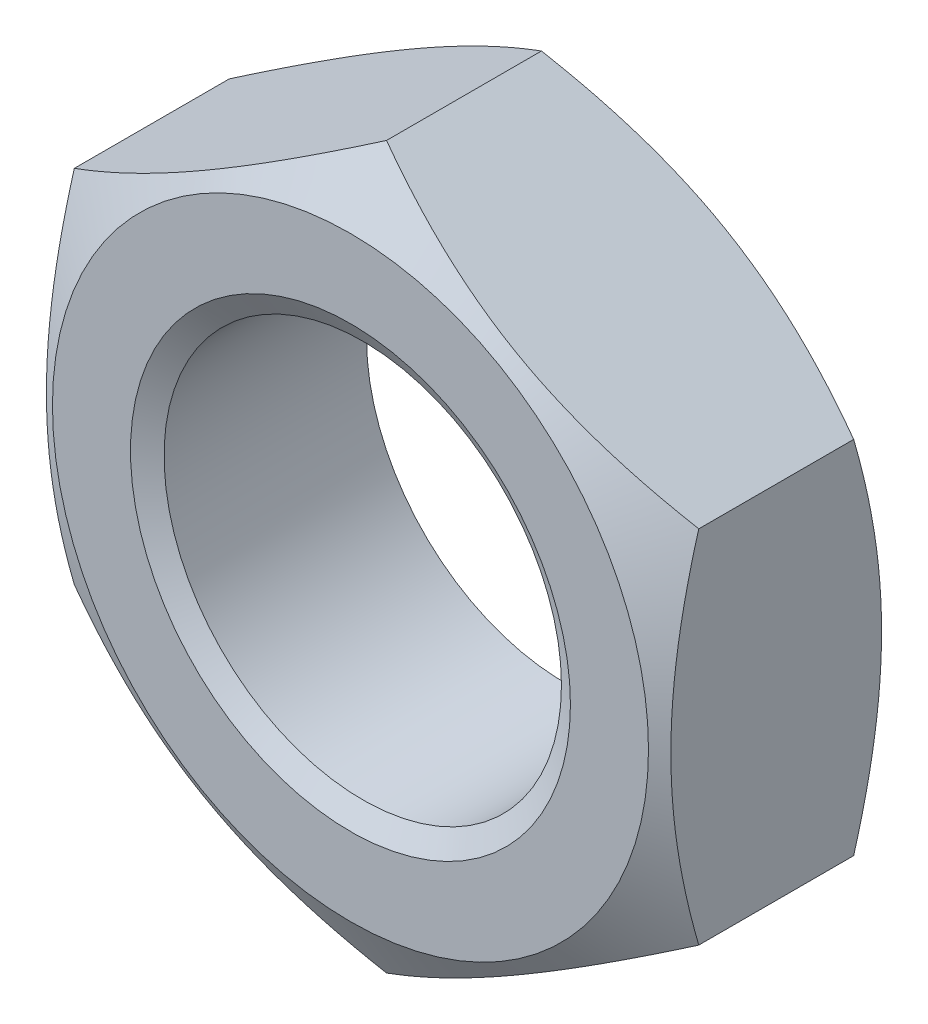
ISO-10303-21;
HEADER;
FILE_DESCRIPTION(('STEP AP214'),'2;1');
FILE_NAME('part.step','',(''),(''),'','','');
FILE_SCHEMA(('AUTOMOTIVE_DESIGN { 1 0 10303 214 1 1 1 1 }'));
ENDSEC;
DATA;
#1=APPLICATION_CONTEXT('core data for automotive mechanical design processes');
#2=APPLICATION_PROTOCOL_DEFINITION('international standard','automotive_design',2000,#1);
#3=PRODUCT_CONTEXT('',#1,'mechanical');
#4=PRODUCT('Part','Part','',(#3));
#5=PRODUCT_RELATED_PRODUCT_CATEGORY('part','',(#4));
#6=PRODUCT_DEFINITION_FORMATION('','',#4);
#7=PRODUCT_DEFINITION_CONTEXT('part definition',#1,'design');
#8=PRODUCT_DEFINITION('design','',#6,#7);
#9=PRODUCT_DEFINITION_SHAPE('','',#8);
#10=(LENGTH_UNIT() NAMED_UNIT(*) SI_UNIT(.MILLI.,.METRE.));
#11=(NAMED_UNIT(*) PLANE_ANGLE_UNIT() SI_UNIT($,.RADIAN.));
#12=(NAMED_UNIT(*) SI_UNIT($,.STERADIAN.) SOLID_ANGLE_UNIT());
#13=UNCERTAINTY_MEASURE_WITH_UNIT(LENGTH_MEASURE(1.E-05),#10,'distance_accuracy_value','');
#14=(GEOMETRIC_REPRESENTATION_CONTEXT(3) GLOBAL_UNCERTAINTY_ASSIGNED_CONTEXT((#13)) GLOBAL_UNIT_ASSIGNED_CONTEXT((#10,
#11,#12)) REPRESENTATION_CONTEXT('',''));
#15=CARTESIAN_POINT('',(0.,0.,0.));
#16=DIRECTION('',(0.,0.,1.));
#17=DIRECTION('',(1.,0.,0.));
#18=AXIS2_PLACEMENT_3D('',#15,#16,#17);
#19=CARTESIAN_POINT('',(11.,6.35085296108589,8.));
#20=DIRECTION('',(-0.5,-0.866025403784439,0.));
#21=DIRECTION('',(0.866025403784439,-0.5,0.));
#22=AXIS2_PLACEMENT_3D('',#19,#20,#21);
#23=PLANE('',#22);
#24=CARTESIAN_POINT('',(-0.000200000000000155,12.7018213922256,1.27122217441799));
#25=CARTESIAN_POINT('',(0.241603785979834,12.5622159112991,1.19063428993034));
#26=CARTESIAN_POINT('',(0.484309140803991,12.4220899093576,1.11370405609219));
#27=CARTESIAN_POINT('',(0.971666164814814,12.1407142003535,0.968173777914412));
#28=CARTESIAN_POINT('',(1.21631844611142,11.999464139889,0.899576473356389));
#29=CARTESIAN_POINT('',(1.9542173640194,11.5734380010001,0.707611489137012));
#30=CARTESIAN_POINT('',(2.45037695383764,11.2869801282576,0.598422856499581));
#31=CARTESIAN_POINT('',(3.19285703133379,10.8583090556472,0.470389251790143));
#32=CARTESIAN_POINT('',(3.43695934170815,10.7173765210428,0.433917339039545));
#33=CARTESIAN_POINT('',(3.92629418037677,10.4348589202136,0.372756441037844));
#34=CARTESIAN_POINT('',(4.17152673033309,10.2932738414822,0.348067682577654));
#35=CARTESIAN_POINT('',(4.66240068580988,10.0098676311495,0.31110548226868));
#36=CARTESIAN_POINT('',(4.90804125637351,9.86804698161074,0.298817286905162));
#37=CARTESIAN_POINT('',(5.39955001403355,9.58427426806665,0.286918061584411));
#38=CARTESIAN_POINT('',(5.64541819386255,9.44232220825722,0.287306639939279));
#39=CARTESIAN_POINT('',(6.10507018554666,9.17694200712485,0.299876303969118));
#40=CARTESIAN_POINT('',(6.31888677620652,9.05349494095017,0.310524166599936));
#41=CARTESIAN_POINT('',(6.74602818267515,8.80688473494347,0.341206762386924));
#42=CARTESIAN_POINT('',(6.95935296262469,8.68372161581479,0.361242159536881));
#43=CARTESIAN_POINT('',(7.3853948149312,8.43774623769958,0.410350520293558));
#44=CARTESIAN_POINT('',(7.5981112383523,8.31493435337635,0.439430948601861));
#45=CARTESIAN_POINT('',(8.02254681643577,8.06988635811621,0.50611913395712));
#46=CARTESIAN_POINT('',(8.23426590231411,7.94765028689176,0.543727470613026));
#47=CARTESIAN_POINT('',(8.87695113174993,7.5765957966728,0.670295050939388));
#48=CARTESIAN_POINT('',(9.30605612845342,7.32885191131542,0.771874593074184));
#49=CARTESIAN_POINT('',(10.1578675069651,6.83705838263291,1.00241883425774));
#50=CARTESIAN_POINT('',(10.580584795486,6.59300244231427,1.13132938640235));
#51=CARTESIAN_POINT('',(11.0002,6.35073749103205,1.27122217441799));
#52=B_SPLINE_CURVE_WITH_KNOTS('',3,(#24,#25,#26,#27,#28,#29,#30,#31,#32,#33,#34,#35,#36,#37,#38,
#39,#40,#41,#42,#43,#44,#45,#46,#47,#48,#49,#50,#51),.UNSPECIFIED.,.F.,.F.,(4,2,2,2,2,2,2,2,2,2,
2,2,2,4),(0.,0.871755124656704,1.74379610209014,3.49159027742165,4.34403665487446,
5.19649943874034,6.04794680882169,6.89936787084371,7.64056020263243,8.38180496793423,
9.12366309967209,9.86557166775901,11.3820155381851,12.8954827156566),.UNSPECIFIED.);
#53=CARTESIAN_POINT('',(0.,12.7017059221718,1.27115550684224));
#54=VERTEX_POINT('',#53);
#55=CARTESIAN_POINT('',(11.,6.35085296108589,1.27115550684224));
#56=VERTEX_POINT('',#55);
#57=EDGE_CURVE('E31',#54,#56,#52,.T.);
#58=ORIENTED_EDGE('',*,*,#57,.F.);
#59=DIRECTION('',(0.,0.,-1.));
#60=VECTOR('',#59,1.);
#61=CARTESIAN_POINT('',(0.,12.7017059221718,8.));
#62=LINE('',#61,#60);
#63=CARTESIAN_POINT('',(0.,12.7017059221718,6.72884449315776));
#64=VERTEX_POINT('',#63);
#65=EDGE_CURVE('E9',#64,#54,#62,.T.);
#66=ORIENTED_EDGE('',*,*,#65,.F.);
#67=CARTESIAN_POINT('',(11.0002,6.35073749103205,6.72877782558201));
#68=CARTESIAN_POINT('',(10.7583962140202,6.49034297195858,6.80936571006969));
#69=CARTESIAN_POINT('',(10.515690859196,6.63046897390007,6.88629594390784));
#70=CARTESIAN_POINT('',(10.0283338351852,6.91184468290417,7.03182622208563));
#71=CARTESIAN_POINT('',(9.78368155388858,7.05309474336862,7.10042352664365));
#72=CARTESIAN_POINT('',(9.0457826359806,7.47912088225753,7.29238851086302));
#73=CARTESIAN_POINT('',(8.54962304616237,7.7655787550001,7.40157714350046));
#74=CARTESIAN_POINT('',(7.80714296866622,8.19424982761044,7.5296107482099));
#75=CARTESIAN_POINT('',(7.56304065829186,8.33518236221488,7.5660826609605));
#76=CARTESIAN_POINT('',(7.07370581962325,8.61769996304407,7.6272435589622));
#77=CARTESIAN_POINT('',(6.82847326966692,8.75928504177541,7.65193231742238));
#78=CARTESIAN_POINT('',(6.33759931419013,9.04269125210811,7.68889451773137));
#79=CARTESIAN_POINT('',(6.09195874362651,9.18451190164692,7.70118271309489));
#80=CARTESIAN_POINT('',(5.60044998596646,9.468284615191,7.71308193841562));
#81=CARTESIAN_POINT('',(5.35458180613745,9.61023667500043,7.71269336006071));
#82=CARTESIAN_POINT('',(4.89492981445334,9.87561687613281,7.70012369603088));
#83=CARTESIAN_POINT('',(4.68111322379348,9.99906394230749,7.68947583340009));
#84=CARTESIAN_POINT('',(4.25397181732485,10.2456741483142,7.65879323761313));
#85=CARTESIAN_POINT('',(4.04064703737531,10.3688372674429,7.63875784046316));
#86=CARTESIAN_POINT('',(3.6146051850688,10.6148126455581,7.58964947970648));
#87=CARTESIAN_POINT('',(3.4018887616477,10.7376245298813,7.56056905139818));
#88=CARTESIAN_POINT('',(2.97745318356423,10.9826725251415,7.49388086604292));
#89=CARTESIAN_POINT('',(2.76573409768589,11.1049085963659,7.45627252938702));
#90=CARTESIAN_POINT('',(2.12304886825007,11.4759630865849,7.32970494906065));
#91=CARTESIAN_POINT('',(1.69394387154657,11.7237069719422,7.22812540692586));
#92=CARTESIAN_POINT('',(0.84213249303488,12.2155005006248,6.9975811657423));
#93=CARTESIAN_POINT('',(0.419415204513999,12.4595564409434,6.86867061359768));
#94=CARTESIAN_POINT('',(-0.000200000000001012,12.7018213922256,6.72877782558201));
#95=B_SPLINE_CURVE_WITH_KNOTS('',3,(#67,#68,#69,#70,#71,#72,#73,#74,#75,#76,#77,#78,#79,#80,#81,
#82,#83,#84,#85,#86,#87,#88,#89,#90,#91,#92,#93,#94),.UNSPECIFIED.,.F.,.F.,(4,2,2,2,2,2,2,2,2,2,
2,2,2,4),(0.,0.87175512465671,1.74379610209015,3.49159027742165,4.34403665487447,
5.19649943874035,6.04794680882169,6.89936787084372,7.64056020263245,8.38180496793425,
9.1236630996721,9.86557166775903,11.3820155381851,12.8954827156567),.UNSPECIFIED.);
#96=CARTESIAN_POINT('',(11.,6.35085296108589,6.72884449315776));
#97=VERTEX_POINT('',#96);
#98=EDGE_CURVE('E182',#97,#64,#95,.T.);
#99=ORIENTED_EDGE('',*,*,#98,.F.);
#100=DIRECTION('',(0.,0.,-1.));
#101=VECTOR('',#100,1.);
#102=CARTESIAN_POINT('',(11.,6.35085296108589,8.));
#103=LINE('',#102,#101);
#104=EDGE_CURVE('E88',#97,#56,#103,.T.);
#105=ORIENTED_EDGE('',*,*,#104,.T.);
#106=EDGE_LOOP('',(#58,#66,#99,#105));
#107=FACE_BOUND('',#106,.T.);
#108=ADVANCED_FACE('F14',(#107),#23,.F.);
#109=CARTESIAN_POINT('',(0.,12.7017059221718,8.));
#110=DIRECTION('',(0.5,-0.866025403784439,0.));
#111=DIRECTION('',(0.866025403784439,0.5,0.));
#112=AXIS2_PLACEMENT_3D('',#109,#110,#111);
#113=PLANE('',#112);
#114=CARTESIAN_POINT('',(-11.0002,6.35073749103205,1.27122217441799));
#115=CARTESIAN_POINT('',(-10.7583962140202,6.49034297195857,1.19063428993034));
#116=CARTESIAN_POINT('',(-10.515690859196,6.63046897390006,1.11370405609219));
#117=CARTESIAN_POINT('',(-10.0283338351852,6.91184468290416,0.968173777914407));
#118=CARTESIAN_POINT('',(-9.78368155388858,7.05309474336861,0.899576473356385));
#119=CARTESIAN_POINT('',(-9.0457826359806,7.47912088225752,0.707611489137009));
#120=CARTESIAN_POINT('',(-8.54962304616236,7.7655787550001,0.598422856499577));
#121=CARTESIAN_POINT('',(-7.80714296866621,8.19424982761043,0.470389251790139));
#122=CARTESIAN_POINT('',(-7.56304065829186,8.33518236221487,0.43391733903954));
#123=CARTESIAN_POINT('',(-7.07370581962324,8.61769996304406,0.372756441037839));
#124=CARTESIAN_POINT('',(-6.82847326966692,8.7592850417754,0.348067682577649));
#125=CARTESIAN_POINT('',(-6.33759931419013,9.0426912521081,0.311105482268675));
#126=CARTESIAN_POINT('',(-6.0919587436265,9.1845119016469,0.298817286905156));
#127=CARTESIAN_POINT('',(-5.60044998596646,9.46828461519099,0.286918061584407));
#128=CARTESIAN_POINT('',(-5.35458180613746,9.61023667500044,0.28730663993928));
#129=CARTESIAN_POINT('',(-4.89492981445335,9.8756168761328,0.299876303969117));
#130=CARTESIAN_POINT('',(-4.68111322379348,9.99906394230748,0.310524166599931));
#131=CARTESIAN_POINT('',(-4.25397181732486,10.2456741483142,0.341206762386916));
#132=CARTESIAN_POINT('',(-4.04064703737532,10.3688372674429,0.361242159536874));
#133=CARTESIAN_POINT('',(-3.61460518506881,10.6148126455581,0.410350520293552));
#134=CARTESIAN_POINT('',(-3.40188876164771,10.7376245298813,0.439430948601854));
#135=CARTESIAN_POINT('',(-2.97745318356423,10.9826725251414,0.506119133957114));
#136=CARTESIAN_POINT('',(-2.76573409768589,11.1049085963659,0.54372747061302));
#137=CARTESIAN_POINT('',(-2.12304886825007,11.4759630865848,0.670295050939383));
#138=CARTESIAN_POINT('',(-1.69394387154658,11.7237069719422,0.771874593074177));
#139=CARTESIAN_POINT('',(-0.842132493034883,12.2155005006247,1.00241883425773));
#140=CARTESIAN_POINT('',(-0.419415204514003,12.4595564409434,1.13132938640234));
#141=CARTESIAN_POINT('',(0.000199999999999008,12.7018213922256,1.27122217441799));
#142=B_SPLINE_CURVE_WITH_KNOTS('',3,(#114,#115,#116,#117,#118,#119,#120,#121,#122,#123,#124,
#125,#126,#127,#128,#129,#130,#131,#132,#133,#134,#135,#136,#137,#138,#139,#140,#141),
.UNSPECIFIED.,.F.,.F.,(4,2,2,2,2,2,2,2,2,2,2,2,2,4),(0.,0.871755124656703,1.74379610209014,
3.49159027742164,4.34403665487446,5.19649943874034,6.04794680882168,6.89936787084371,
7.64056020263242,8.38180496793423,9.12366309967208,9.865571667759,11.3820155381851,
12.8954827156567),.UNSPECIFIED.);
#143=CARTESIAN_POINT('',(-11.,6.35085296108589,1.27115550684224));
#144=VERTEX_POINT('',#143);
#145=EDGE_CURVE('E195',#144,#54,#142,.T.);
#146=ORIENTED_EDGE('',*,*,#145,.F.);
#147=DIRECTION('',(0.,0.,-1.));
#148=VECTOR('',#147,1.);
#149=CARTESIAN_POINT('',(-11.,6.35085296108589,8.));
#150=LINE('',#149,#148);
#151=CARTESIAN_POINT('',(-11.,6.35085296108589,6.72884449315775));
#152=VERTEX_POINT('',#151);
#153=EDGE_CURVE('E23',#152,#144,#150,.T.);
#154=ORIENTED_EDGE('',*,*,#153,.F.);
#155=CARTESIAN_POINT('',(0.00019999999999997,12.7018213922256,6.72877782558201));
#156=CARTESIAN_POINT('',(-0.241603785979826,12.5622159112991,6.80936571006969));
#157=CARTESIAN_POINT('',(-0.48430914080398,12.4220899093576,6.88629594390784));
#158=CARTESIAN_POINT('',(-0.971666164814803,12.1407142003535,7.03182622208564));
#159=CARTESIAN_POINT('',(-1.21631844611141,11.999464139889,7.10042352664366));
#160=CARTESIAN_POINT('',(-1.9542173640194,11.5734380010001,7.29238851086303));
#161=CARTESIAN_POINT('',(-2.45037695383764,11.2869801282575,7.40157714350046));
#162=CARTESIAN_POINT('',(-3.19285703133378,10.8583090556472,7.5296107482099));
#163=CARTESIAN_POINT('',(-3.43695934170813,10.7173765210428,7.5660826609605));
#164=CARTESIAN_POINT('',(-3.92629418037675,10.4348589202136,7.6272435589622));
#165=CARTESIAN_POINT('',(-4.17152673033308,10.2932738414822,7.65193231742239));
#166=CARTESIAN_POINT('',(-4.66240068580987,10.0098676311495,7.68889451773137));
#167=CARTESIAN_POINT('',(-4.9080412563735,9.86804698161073,7.7011827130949));
#168=CARTESIAN_POINT('',(-5.39955001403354,9.58427426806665,7.71308193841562));
#169=CARTESIAN_POINT('',(-5.64541819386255,9.44232220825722,7.71269336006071));
#170=CARTESIAN_POINT('',(-6.10507018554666,9.17694200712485,7.70012369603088));
#171=CARTESIAN_POINT('',(-6.31888677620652,9.05349494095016,7.6894758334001));
#172=CARTESIAN_POINT('',(-6.74602818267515,8.80688473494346,7.65879323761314));
#173=CARTESIAN_POINT('',(-6.95935296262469,8.68372161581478,7.63875784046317));
#174=CARTESIAN_POINT('',(-7.3853948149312,8.43774623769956,7.58964947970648));
#175=CARTESIAN_POINT('',(-7.5981112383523,8.31493435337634,7.56056905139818));
#176=CARTESIAN_POINT('',(-8.02254681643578,8.06988635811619,7.49388086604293));
#177=CARTESIAN_POINT('',(-8.23426590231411,7.94765028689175,7.45627252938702));
#178=CARTESIAN_POINT('',(-8.87695113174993,7.57659579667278,7.32970494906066));
#179=CARTESIAN_POINT('',(-9.30605612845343,7.32885191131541,7.22812540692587));
#180=CARTESIAN_POINT('',(-10.1578675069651,6.8370583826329,6.9975811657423));
#181=CARTESIAN_POINT('',(-10.580584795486,6.59300244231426,6.86867061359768));
#182=CARTESIAN_POINT('',(-11.0002,6.35073749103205,6.728777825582));
#183=B_SPLINE_CURVE_WITH_KNOTS('',3,(#155,#156,#157,#158,#159,#160,#161,#162,#163,#164,#165,
#166,#167,#168,#169,#170,#171,#172,#173,#174,#175,#176,#177,#178,#179,#180,#181,#182),
.UNSPECIFIED.,.F.,.F.,(4,2,2,2,2,2,2,2,2,2,2,2,2,4),(0.,0.871755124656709,1.74379610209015,
3.49159027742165,4.34403665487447,5.19649943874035,6.0479468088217,6.89936787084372,
7.64056020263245,8.38180496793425,9.12366309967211,9.86557166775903,11.3820155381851,
12.8954827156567),.UNSPECIFIED.);
#184=EDGE_CURVE('E177',#64,#152,#183,.T.);
#185=ORIENTED_EDGE('',*,*,#184,.F.);
#186=ORIENTED_EDGE('',*,*,#65,.T.);
#187=EDGE_LOOP('',(#146,#154,#185,#186));
#188=FACE_BOUND('',#187,.T.);
#189=ADVANCED_FACE('F188',(#188),#113,.F.);
#190=CARTESIAN_POINT('',(-11.,6.35085296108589,8.));
#191=DIRECTION('',(1.,0.,0.));
#192=DIRECTION('',(0.,1.,0.));
#193=AXIS2_PLACEMENT_3D('',#190,#191,#192);
#194=PLANE('',#193);
#195=CARTESIAN_POINT('',(-11.,-16.9671719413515,5.61236604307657));
#196=CARTESIAN_POINT('',(-11.,-16.727338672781,5.49618133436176));
#197=CARTESIAN_POINT('',(-11.,-16.4872214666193,5.38058302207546));
#198=CARTESIAN_POINT('',(-11.,-16.0063598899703,5.15069218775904));
#199=CARTESIAN_POINT('',(-11.,-15.7656155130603,5.03639967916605));
#200=CARTESIAN_POINT('',(-11.,-15.0422872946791,4.69564963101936));
#201=CARTESIAN_POINT('',(-11.,-14.5586807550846,4.47135473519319));
#202=CARTESIAN_POINT('',(-11.,-13.585524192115,4.02867864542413));
#203=CARTESIAN_POINT('',(-11.,-13.0959560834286,3.81033711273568));
#204=CARTESIAN_POINT('',(-11.,-12.1128940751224,3.38270980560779));
#205=CARTESIAN_POINT('',(-11.,-11.6194003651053,3.17342359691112));
#206=CARTESIAN_POINT('',(-11.,-10.6121434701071,2.75991916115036));
#207=CARTESIAN_POINT('',(-11.,-10.0982298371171,2.55606547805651));
#208=CARTESIAN_POINT('',(-11.,-9.06435257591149,2.16400984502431));
#209=CARTESIAN_POINT('',(-11.,-8.54438827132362,1.97580966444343));
#210=CARTESIAN_POINT('',(-11.,-7.49860296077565,1.62007182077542));
#211=CARTESIAN_POINT('',(-11.,-6.97279657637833,1.45249152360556));
#212=CARTESIAN_POINT('',(-11.,-5.91359220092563,1.14342247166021));
#213=CARTESIAN_POINT('',(-11.,-5.38019668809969,1.00192540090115));
#214=CARTESIAN_POINT('',(-11.,-4.57579291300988,0.814791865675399));
#215=CARTESIAN_POINT('',(-11.,-4.30765917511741,0.75672084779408));
#216=CARTESIAN_POINT('',(-11.,-3.76957706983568,0.649650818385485));
#217=CARTESIAN_POINT('',(-11.,-3.49962874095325,0.600651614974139));
#218=CARTESIAN_POINT('',(-11.,-2.95810989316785,0.512595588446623));
#219=CARTESIAN_POINT('',(-11.,-2.68653939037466,0.473538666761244));
#220=CARTESIAN_POINT('',(-11.,-2.14207199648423,0.406149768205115));
#221=CARTESIAN_POINT('',(-11.,-1.86917515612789,0.377817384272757));
#222=CARTESIAN_POINT('',(-11.,-1.32595910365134,0.332790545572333));
#223=CARTESIAN_POINT('',(-11.,-1.05565200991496,0.315950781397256));
#224=CARTESIAN_POINT('',(-11.,-0.514568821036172,0.293710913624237));
#225=CARTESIAN_POINT('',(-11.,-0.243792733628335,0.288310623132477));
#226=CARTESIAN_POINT('',(-11.,0.29774654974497,0.289077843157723));
#227=CARTESIAN_POINT('',(-11.,0.568509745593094,0.295245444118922));
#228=CARTESIAN_POINT('',(-11.,1.10953808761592,0.31899961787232));
#229=CARTESIAN_POINT('',(-11.,1.37980320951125,0.336586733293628));
#230=CARTESIAN_POINT('',(-11.,2.03213954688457,0.39244898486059));
#231=CARTESIAN_POINT('',(-11.,2.4137416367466,0.436297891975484));
#232=CARTESIAN_POINT('',(-11.,3.17405500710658,0.544351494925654));
#233=CARTESIAN_POINT('',(-11.,3.55276587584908,0.608559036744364));
#234=CARTESIAN_POINT('',(-11.,4.306955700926,0.755045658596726));
#235=CARTESIAN_POINT('',(-11.,4.68243184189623,0.837339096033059));
#236=CARTESIAN_POINT('',(-11.,5.42958919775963,1.01749179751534));
#237=CARTESIAN_POINT('',(-11.,5.80127047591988,1.11535080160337));
#238=CARTESIAN_POINT('',(-11.,6.54897060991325,1.32656055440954));
#239=CARTESIAN_POINT('',(-11.,6.92490635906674,1.44020348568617));
#240=CARTESIAN_POINT('',(-11.,7.67307346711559,1.67902984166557));
#241=CARTESIAN_POINT('',(-11.,8.04530480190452,1.80421334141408));
#242=CARTESIAN_POINT('',(-11.,8.78625070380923,2.06415081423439));
#243=CARTESIAN_POINT('',(-11.,9.15496643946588,2.19890147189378));
#244=CARTESIAN_POINT('',(-11.,9.88935595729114,2.47640770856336));
#245=CARTESIAN_POINT('',(-11.,10.2550297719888,2.61916320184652));
#246=CARTESIAN_POINT('',(-11.,11.1052398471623,2.96009087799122));
#247=CARTESIAN_POINT('',(-11.,11.5887320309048,3.16086259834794));
#248=CARTESIAN_POINT('',(-11.,12.5517192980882,3.57179980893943));
#249=CARTESIAN_POINT('',(-11.,13.0312141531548,3.78196583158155));
#250=CARTESIAN_POINT('',(-11.,13.9869352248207,4.20984445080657));
#251=CARTESIAN_POINT('',(-11.,14.4631607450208,4.4275585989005));
#252=CARTESIAN_POINT('',(-11.,15.4127797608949,4.86903982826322));
#253=CARTESIAN_POINT('',(-11.,15.8861733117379,5.09280679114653));
#254=CARTESIAN_POINT('',(-11.,16.8310774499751,5.54551532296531));
#255=CARTESIAN_POINT('',(-11.,17.3025855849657,5.7744620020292));
#256=CARTESIAN_POINT('',(-11.,18.2435987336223,6.23643470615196));
#257=CARTESIAN_POINT('',(-11.,18.7131037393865,6.46946074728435));
#258=CARTESIAN_POINT('',(-11.,19.6503574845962,6.9388760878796));
#259=CARTESIAN_POINT('',(-11.,20.1181064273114,7.17526498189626));
#260=CARTESIAN_POINT('',(-11.,21.0521543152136,7.65089185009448));
#261=CARTESIAN_POINT('',(-11.,21.518453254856,7.89012983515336));
#262=CARTESIAN_POINT('',(-11.,22.8395381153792,8.57222787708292));
#263=CARTESIAN_POINT('',(-11.,23.6928530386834,9.01793696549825));
#264=CARTESIAN_POINT('',(-11.,25.3963113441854,9.91542815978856));
#265=CARTESIAN_POINT('',(-11.,26.2464546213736,10.3672104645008));
#266=CARTESIAN_POINT('',(-11.,27.9422372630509,11.2743650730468));
#267=CARTESIAN_POINT('',(-11.,28.7878825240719,11.7297263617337));
#268=CARTESIAN_POINT('',(-11.,30.0548481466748,12.4154880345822));
#269=CARTESIAN_POINT('',(-11.,30.4769088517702,12.6445226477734));
#270=CARTESIAN_POINT('',(-11.,31.3205853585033,13.1034083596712));
#271=CARTESIAN_POINT('',(-11.,31.7422011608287,13.3332594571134));
#272=CARTESIAN_POINT('',(-11.,32.1636194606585,13.5634721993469));
#273=B_SPLINE_CURVE_WITH_KNOTS('',3,(#195,#196,#197,#198,#199,#200,#201,#202,#203,#204,#205,
#206,#207,#208,#209,#210,#211,#212,#213,#214,#215,#216,#217,#218,#219,#220,#221,#222,#223,#224,
#225,#226,#227,#228,#229,#230,#231,#232,#233,#234,#235,#236,#237,#238,#239,#240,#241,#242,#243,
#244,#245,#246,#247,#248,#249,#250,#251,#252,#253,#254,#255,#256,#257,#258,#259,#260,#261,#262,
#263,#264,#265,#266,#267,#268,#269,#270,#271,#272),.UNSPECIFIED.,.F.,.F.,(4,2,2,2,2,2,2,2,2,2,2,
2,2,2,2,2,2,2,2,2,2,2,2,2,2,2,2,2,2,2,2,2,2,2,2,2,2,2,4),(0.,0.799479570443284,1.59896736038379,
3.19818436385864,4.80626395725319,6.4142663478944,8.07267709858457,9.73127504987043,
11.3863838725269,13.0409640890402,13.8638855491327,14.686789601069,15.5096854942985,
16.3325501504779,17.1448077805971,17.9570521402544,18.7693028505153,19.5815921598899,
20.7332921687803,21.8851532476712,23.0379320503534,24.1906916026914,25.3686809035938,
26.5466778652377,27.7242685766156,28.9018466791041,30.4722754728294,32.0427933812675,
33.6136360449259,35.1844480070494,36.7568837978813,38.3293257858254,39.9015797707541,
41.4738397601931,44.3619210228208,47.2500970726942,50.1314436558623,51.5720431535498,
53.0126404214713),.UNSPECIFIED.);
#274=CARTESIAN_POINT('',(-11.,-6.35085296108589,1.27115550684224));
#275=VERTEX_POINT('',#274);
#276=EDGE_CURVE('E201',#275,#144,#273,.T.);
#277=ORIENTED_EDGE('',*,*,#276,.F.);
#278=DIRECTION('',(0.,0.,-1.));
#279=VECTOR('',#278,1.);
#280=CARTESIAN_POINT('',(-11.,-6.35085296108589,8.));
#281=LINE('',#280,#279);
#282=CARTESIAN_POINT('',(-11.,-6.35085296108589,6.72884449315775));
#283=VERTEX_POINT('',#282);
#284=EDGE_CURVE('E90',#283,#275,#281,.T.);
#285=ORIENTED_EDGE('',*,*,#284,.F.);
#286=CARTESIAN_POINT('',(-11.,-16.9671719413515,2.38763395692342));
#287=CARTESIAN_POINT('',(-11.,-16.727338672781,2.50381866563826));
#288=CARTESIAN_POINT('',(-11.,-16.4872214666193,2.61941697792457));
#289=CARTESIAN_POINT('',(-11.,-16.0063598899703,2.84930781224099));
#290=CARTESIAN_POINT('',(-11.,-15.7656155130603,2.96360032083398));
#291=CARTESIAN_POINT('',(-11.,-15.0422872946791,3.30435036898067));
#292=CARTESIAN_POINT('',(-11.,-14.5586807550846,3.52864526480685));
#293=CARTESIAN_POINT('',(-11.,-13.585524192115,3.9713213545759));
#294=CARTESIAN_POINT('',(-11.,-13.0959560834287,4.18966288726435));
#295=CARTESIAN_POINT('',(-11.,-12.1128940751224,4.61729019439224));
#296=CARTESIAN_POINT('',(-11.,-11.6194003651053,4.82657640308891));
#297=CARTESIAN_POINT('',(-11.,-10.6121434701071,5.24008083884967));
#298=CARTESIAN_POINT('',(-11.,-10.0982298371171,5.44393452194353));
#299=CARTESIAN_POINT('',(-11.,-9.06435257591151,5.83599015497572));
#300=CARTESIAN_POINT('',(-11.,-8.54438827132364,6.0241903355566));
#301=CARTESIAN_POINT('',(-11.,-7.49860296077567,6.37992817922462));
#302=CARTESIAN_POINT('',(-11.,-6.97279657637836,6.54750847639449));
#303=CARTESIAN_POINT('',(-11.,-5.91359220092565,6.85657752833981));
#304=CARTESIAN_POINT('',(-11.,-5.38019668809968,6.99807459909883));
#305=CARTESIAN_POINT('',(-11.,-4.57579291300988,7.18520813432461));
#306=CARTESIAN_POINT('',(-11.,-4.30765917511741,7.24327915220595));
#307=CARTESIAN_POINT('',(-11.,-3.76957706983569,7.35034918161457));
#308=CARTESIAN_POINT('',(-11.,-3.49962874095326,7.39934838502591));
#309=CARTESIAN_POINT('',(-11.,-2.95810989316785,7.48740441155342));
#310=CARTESIAN_POINT('',(-11.,-2.68653939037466,7.5264613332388));
#311=CARTESIAN_POINT('',(-11.,-2.14207199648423,7.59385023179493));
#312=CARTESIAN_POINT('',(-11.,-1.86917515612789,7.62218261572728));
#313=CARTESIAN_POINT('',(-11.,-1.32595910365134,7.66720945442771));
#314=CARTESIAN_POINT('',(-11.,-1.05565200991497,7.68404921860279));
#315=CARTESIAN_POINT('',(-11.,-0.514568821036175,7.7062890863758));
#316=CARTESIAN_POINT('',(-11.,-0.243792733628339,7.71168937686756));
#317=CARTESIAN_POINT('',(-11.,0.297746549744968,7.71092215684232));
#318=CARTESIAN_POINT('',(-11.,0.568509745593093,7.70475455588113));
#319=CARTESIAN_POINT('',(-11.,1.10953808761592,7.68100038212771));
#320=CARTESIAN_POINT('',(-11.,1.37980320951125,7.66341326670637));
#321=CARTESIAN_POINT('',(-11.,2.03213954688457,7.6075510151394));
#322=CARTESIAN_POINT('',(-11.,2.41374163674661,7.56370210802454));
#323=CARTESIAN_POINT('',(-11.,3.17405500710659,7.4556485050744));
#324=CARTESIAN_POINT('',(-11.,3.55276587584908,7.39144096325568));
#325=CARTESIAN_POINT('',(-11.,4.30695570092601,7.24495434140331));
#326=CARTESIAN_POINT('',(-11.,4.68243184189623,7.16266090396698));
#327=CARTESIAN_POINT('',(-11.,5.42958919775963,6.9825082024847));
#328=CARTESIAN_POINT('',(-11.,5.80127047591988,6.88464919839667));
#329=CARTESIAN_POINT('',(-11.,6.54897060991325,6.6734394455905));
#330=CARTESIAN_POINT('',(-11.,6.92490635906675,6.55979651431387));
#331=CARTESIAN_POINT('',(-11.,7.67307346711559,6.32097015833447));
#332=CARTESIAN_POINT('',(-11.,8.04530480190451,6.19578665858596));
#333=CARTESIAN_POINT('',(-11.,8.78625070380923,5.93584918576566));
#334=CARTESIAN_POINT('',(-11.,9.15496643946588,5.80109852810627));
#335=CARTESIAN_POINT('',(-11.,9.88935595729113,5.52359229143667));
#336=CARTESIAN_POINT('',(-11.,10.2550297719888,5.38083679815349));
#337=CARTESIAN_POINT('',(-11.,11.1052398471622,5.03990912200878));
#338=CARTESIAN_POINT('',(-11.,11.5887320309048,4.83913740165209));
#339=CARTESIAN_POINT('',(-11.,12.5517192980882,4.42820019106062));
#340=CARTESIAN_POINT('',(-11.,13.0312141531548,4.21803416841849));
#341=CARTESIAN_POINT('',(-11.,13.9869352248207,3.79015554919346));
#342=CARTESIAN_POINT('',(-11.,14.4631607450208,3.57244140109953));
#343=CARTESIAN_POINT('',(-11.,15.412779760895,3.13096017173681));
#344=CARTESIAN_POINT('',(-11.,15.8861733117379,2.9071932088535));
#345=CARTESIAN_POINT('',(-11.,16.8310774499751,2.45448467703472));
#346=CARTESIAN_POINT('',(-11.,17.3025855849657,2.22553799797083));
#347=CARTESIAN_POINT('',(-11.,18.2435987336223,1.76356529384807));
#348=CARTESIAN_POINT('',(-11.,18.7131037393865,1.53053925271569));
#349=CARTESIAN_POINT('',(-11.,19.6503574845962,1.06112391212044));
#350=CARTESIAN_POINT('',(-11.,20.1181064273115,0.824735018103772));
#351=CARTESIAN_POINT('',(-11.,21.0521543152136,0.349108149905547));
#352=CARTESIAN_POINT('',(-11.,21.518453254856,0.109870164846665));
#353=CARTESIAN_POINT('',(-11.,22.8395381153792,-0.572227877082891));
#354=CARTESIAN_POINT('',(-11.,23.6928530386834,-1.01793696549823));
#355=CARTESIAN_POINT('',(-11.,25.3963113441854,-1.91542815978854));
#356=CARTESIAN_POINT('',(-11.,26.2464546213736,-2.36721046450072));
#357=CARTESIAN_POINT('',(-11.,27.9422372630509,-3.27436507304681));
#358=CARTESIAN_POINT('',(-11.,28.787882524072,-3.72972636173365));
#359=CARTESIAN_POINT('',(-11.,30.0548481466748,-4.41548803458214));
#360=CARTESIAN_POINT('',(-11.,30.4769088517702,-4.64452264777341));
#361=CARTESIAN_POINT('',(-11.,31.3205853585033,-5.10340835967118));
#362=CARTESIAN_POINT('',(-11.,31.7422011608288,-5.33325945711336));
#363=CARTESIAN_POINT('',(-11.,32.1636194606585,-5.56347219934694));
#364=B_SPLINE_CURVE_WITH_KNOTS('',3,(#286,#287,#288,#289,#290,#291,#292,#293,#294,#295,#296,
#297,#298,#299,#300,#301,#302,#303,#304,#305,#306,#307,#308,#309,#310,#311,#312,#313,#314,#315,
#316,#317,#318,#319,#320,#321,#322,#323,#324,#325,#326,#327,#328,#329,#330,#331,#332,#333,#334,
#335,#336,#337,#338,#339,#340,#341,#342,#343,#344,#345,#346,#347,#348,#349,#350,#351,#352,#353,
#354,#355,#356,#357,#358,#359,#360,#361,#362,#363),.UNSPECIFIED.,.F.,.F.,(4,2,2,2,2,2,2,2,2,2,2,
2,2,2,2,2,2,2,2,2,2,2,2,2,2,2,2,2,2,2,2,2,2,2,2,2,2,2,4),(0.,0.799479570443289,1.5989673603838,
3.19818436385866,4.80626395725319,6.41426634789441,8.07267709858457,9.73127504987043,
11.3863838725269,13.0409640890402,13.8638855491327,14.6867896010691,15.5096854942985,
16.3325501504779,17.1448077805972,17.9570521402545,18.7693028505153,19.5815921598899,
20.7332921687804,21.8851532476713,23.0379320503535,24.1906916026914,25.3686809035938,
26.5466778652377,27.7242685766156,28.9018466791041,30.4722754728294,32.0427933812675,
33.6136360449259,35.1844480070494,36.7568837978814,38.3293257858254,39.9015797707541,
41.4738397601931,44.3619210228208,47.2500970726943,50.1314436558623,51.5720431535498,
53.0126404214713),.UNSPECIFIED.);
#365=EDGE_CURVE('E170',#152,#283,#364,.F.);
#366=ORIENTED_EDGE('',*,*,#365,.F.);
#367=ORIENTED_EDGE('',*,*,#153,.T.);
#368=EDGE_LOOP('',(#277,#285,#366,#367));
#369=FACE_BOUND('',#368,.T.);
#370=ADVANCED_FACE('F191',(#369),#194,.F.);
#371=CARTESIAN_POINT('',(-11.,-6.35085296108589,8.));
#372=DIRECTION('',(0.5,0.866025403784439,0.));
#373=DIRECTION('',(-0.866025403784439,0.5,0.));
#374=AXIS2_PLACEMENT_3D('',#371,#372,#373);
#375=PLANE('',#374);
#376=CARTESIAN_POINT('',(0.000199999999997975,-12.7018213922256,1.27122217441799));
#377=CARTESIAN_POINT('',(-0.241603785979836,-12.5622159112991,1.19063428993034));
#378=CARTESIAN_POINT('',(-0.484309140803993,-12.4220899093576,1.11370405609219));
#379=CARTESIAN_POINT('',(-0.971666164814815,-12.1407142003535,0.968173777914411));
#380=CARTESIAN_POINT('',(-1.21631844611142,-11.999464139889,0.899576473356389));
#381=CARTESIAN_POINT('',(-1.9542173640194,-11.5734380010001,0.707611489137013));
#382=CARTESIAN_POINT('',(-2.45037695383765,-11.2869801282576,0.598422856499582));
#383=CARTESIAN_POINT('',(-3.19285703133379,-10.8583090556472,0.470389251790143));
#384=CARTESIAN_POINT('',(-3.43695934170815,-10.7173765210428,0.433917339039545));
#385=CARTESIAN_POINT('',(-3.92629418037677,-10.4348589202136,0.372756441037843));
#386=CARTESIAN_POINT('',(-4.17152673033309,-10.2932738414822,0.348067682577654));
#387=CARTESIAN_POINT('',(-4.66240068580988,-10.0098676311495,0.31110548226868));
#388=CARTESIAN_POINT('',(-4.90804125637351,-9.86804698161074,0.298817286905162));
#389=CARTESIAN_POINT('',(-5.39955001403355,-9.58427426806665,0.286918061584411));
#390=CARTESIAN_POINT('',(-5.64541819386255,-9.44232220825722,0.28730663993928));
#391=CARTESIAN_POINT('',(-6.10507018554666,-9.17694200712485,0.299876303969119));
#392=CARTESIAN_POINT('',(-6.31888677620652,-9.05349494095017,0.310524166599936));
#393=CARTESIAN_POINT('',(-6.74602818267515,-8.80688473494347,0.341206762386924));
#394=CARTESIAN_POINT('',(-6.95935296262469,-8.68372161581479,0.361242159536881));
#395=CARTESIAN_POINT('',(-7.3853948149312,-8.43774623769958,0.410350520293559));
#396=CARTESIAN_POINT('',(-7.5981112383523,-8.31493435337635,0.439430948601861));
#397=CARTESIAN_POINT('',(-8.02254681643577,-8.06988635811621,0.50611913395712));
#398=CARTESIAN_POINT('',(-8.23426590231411,-7.94765028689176,0.543727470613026));
#399=CARTESIAN_POINT('',(-8.87695113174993,-7.5765957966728,0.670295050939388));
#400=CARTESIAN_POINT('',(-9.30605612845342,-7.32885191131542,0.771874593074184));
#401=CARTESIAN_POINT('',(-10.1578675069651,-6.83705838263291,1.00241883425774));
#402=CARTESIAN_POINT('',(-10.580584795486,-6.59300244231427,1.13132938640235));
#403=CARTESIAN_POINT('',(-11.0002,-6.35073749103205,1.27122217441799));
#404=B_SPLINE_CURVE_WITH_KNOTS('',3,(#376,#377,#378,#379,#380,#381,#382,#383,#384,#385,#386,
#387,#388,#389,#390,#391,#392,#393,#394,#395,#396,#397,#398,#399,#400,#401,#402,#403),
.UNSPECIFIED.,.F.,.F.,(4,2,2,2,2,2,2,2,2,2,2,2,2,4),(0.,0.871755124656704,1.74379610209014,
3.49159027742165,4.34403665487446,5.19649943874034,6.04794680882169,6.89936787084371,
7.64056020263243,8.38180496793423,9.12366309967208,9.86557166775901,11.3820155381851,
12.8954827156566),.UNSPECIFIED.);
#405=CARTESIAN_POINT('',(0.,-12.7017059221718,1.27115550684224));
#406=VERTEX_POINT('',#405);
#407=EDGE_CURVE('E84',#406,#275,#404,.T.);
#408=ORIENTED_EDGE('',*,*,#407,.F.);
#409=DIRECTION('',(0.,0.,-1.));
#410=VECTOR('',#409,1.);
#411=CARTESIAN_POINT('',(0.,-12.7017059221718,8.));
#412=LINE('',#411,#410);
#413=CARTESIAN_POINT('',(0.,-12.7017059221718,6.72884449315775));
#414=VERTEX_POINT('',#413);
#415=EDGE_CURVE('E83',#414,#406,#412,.T.);
#416=ORIENTED_EDGE('',*,*,#415,.F.);
#417=CARTESIAN_POINT('',(-11.0002,-6.35073749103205,6.728777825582));
#418=CARTESIAN_POINT('',(-10.7583962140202,-6.49034297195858,6.80936571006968));
#419=CARTESIAN_POINT('',(-10.515690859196,-6.63046897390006,6.88629594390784));
#420=CARTESIAN_POINT('',(-10.0283338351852,-6.91184468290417,7.03182622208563));
#421=CARTESIAN_POINT('',(-9.78368155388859,-7.05309474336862,7.10042352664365));
#422=CARTESIAN_POINT('',(-9.0457826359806,-7.47912088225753,7.29238851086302));
#423=CARTESIAN_POINT('',(-8.54962304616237,-7.7655787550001,7.40157714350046));
#424=CARTESIAN_POINT('',(-7.80714296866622,-8.19424982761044,7.5296107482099));
#425=CARTESIAN_POINT('',(-7.56304065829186,-8.33518236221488,7.5660826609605));
#426=CARTESIAN_POINT('',(-7.07370581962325,-8.61769996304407,7.6272435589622));
#427=CARTESIAN_POINT('',(-6.82847326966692,-8.75928504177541,7.65193231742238));
#428=CARTESIAN_POINT('',(-6.33759931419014,-9.04269125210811,7.68889451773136));
#429=CARTESIAN_POINT('',(-6.09195874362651,-9.18451190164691,7.70118271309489));
#430=CARTESIAN_POINT('',(-5.60044998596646,-9.468284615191,7.71308193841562));
#431=CARTESIAN_POINT('',(-5.35458180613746,-9.61023667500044,7.71269336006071));
#432=CARTESIAN_POINT('',(-4.89492981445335,-9.87561687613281,7.70012369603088));
#433=CARTESIAN_POINT('',(-4.68111322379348,-9.99906394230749,7.68947583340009));
#434=CARTESIAN_POINT('',(-4.25397181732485,-10.2456741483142,7.65879323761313));
#435=CARTESIAN_POINT('',(-4.04064703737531,-10.3688372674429,7.63875784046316));
#436=CARTESIAN_POINT('',(-3.6146051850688,-10.6148126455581,7.58964947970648));
#437=CARTESIAN_POINT('',(-3.4018887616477,-10.7376245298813,7.56056905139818));
#438=CARTESIAN_POINT('',(-2.97745318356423,-10.9826725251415,7.49388086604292));
#439=CARTESIAN_POINT('',(-2.76573409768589,-11.1049085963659,7.45627252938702));
#440=CARTESIAN_POINT('',(-2.12304886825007,-11.4759630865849,7.32970494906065));
#441=CARTESIAN_POINT('',(-1.69394387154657,-11.7237069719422,7.22812540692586));
#442=CARTESIAN_POINT('',(-0.842132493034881,-12.2155005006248,6.9975811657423));
#443=CARTESIAN_POINT('',(-0.419415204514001,-12.4595564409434,6.86867061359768));
#444=CARTESIAN_POINT('',(0.000199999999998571,-12.7018213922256,6.728777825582));
#445=B_SPLINE_CURVE_WITH_KNOTS('',3,(#417,#418,#419,#420,#421,#422,#423,#424,#425,#426,#427,
#428,#429,#430,#431,#432,#433,#434,#435,#436,#437,#438,#439,#440,#441,#442,#443,#444),
.UNSPECIFIED.,.F.,.F.,(4,2,2,2,2,2,2,2,2,2,2,2,2,4),(0.,0.87175512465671,1.74379610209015,
3.49159027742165,4.34403665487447,5.19649943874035,6.04794680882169,6.89936787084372,
7.64056020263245,8.38180496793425,9.1236630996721,9.86557166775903,11.3820155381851,
12.8954827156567),.UNSPECIFIED.);
#446=EDGE_CURVE('E164',#283,#414,#445,.T.);
#447=ORIENTED_EDGE('',*,*,#446,.F.);
#448=ORIENTED_EDGE('',*,*,#284,.T.);
#449=EDGE_LOOP('',(#408,#416,#447,#448));
#450=FACE_BOUND('',#449,.T.);
#451=ADVANCED_FACE('F210',(#450),#375,.F.);
#452=CARTESIAN_POINT('',(0.,-12.7017059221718,8.));
#453=DIRECTION('',(-0.5,0.866025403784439,0.));
#454=DIRECTION('',(-0.866025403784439,-0.5,0.));
#455=AXIS2_PLACEMENT_3D('',#452,#453,#454);
#456=PLANE('',#455);
#457=CARTESIAN_POINT('',(11.0002,-6.35073749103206,1.27122217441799));
#458=CARTESIAN_POINT('',(10.7583962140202,-6.49034297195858,1.19063428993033));
#459=CARTESIAN_POINT('',(10.515690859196,-6.63046897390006,1.11370405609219));
#460=CARTESIAN_POINT('',(10.0283338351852,-6.91184468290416,0.968173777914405));
#461=CARTESIAN_POINT('',(9.78368155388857,-7.05309474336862,0.899576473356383));
#462=CARTESIAN_POINT('',(9.04578263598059,-7.47912088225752,0.707611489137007));
#463=CARTESIAN_POINT('',(8.54962304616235,-7.7655787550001,0.598422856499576));
#464=CARTESIAN_POINT('',(7.8071429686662,-8.19424982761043,0.470389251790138));
#465=CARTESIAN_POINT('',(7.56304065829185,-8.33518236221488,0.433917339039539));
#466=CARTESIAN_POINT('',(7.07370581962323,-8.61769996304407,0.372756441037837));
#467=CARTESIAN_POINT('',(6.82847326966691,-8.75928504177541,0.348067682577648));
#468=CARTESIAN_POINT('',(6.33759931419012,-9.0426912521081,0.311105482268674));
#469=CARTESIAN_POINT('',(6.09195874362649,-9.18451190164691,0.298817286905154));
#470=CARTESIAN_POINT('',(5.60044998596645,-9.468284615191,0.286918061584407));
#471=CARTESIAN_POINT('',(5.35458180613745,-9.61023667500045,0.287306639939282));
#472=CARTESIAN_POINT('',(4.89492981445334,-9.87561687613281,0.299876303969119));
#473=CARTESIAN_POINT('',(4.68111322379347,-9.99906394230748,0.310524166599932));
#474=CARTESIAN_POINT('',(4.25397181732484,-10.2456741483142,0.341206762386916));
#475=CARTESIAN_POINT('',(4.0406470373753,-10.3688372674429,0.361242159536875));
#476=CARTESIAN_POINT('',(3.6146051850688,-10.6148126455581,0.410350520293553));
#477=CARTESIAN_POINT('',(3.4018887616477,-10.7376245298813,0.439430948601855));
#478=CARTESIAN_POINT('',(2.97745318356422,-10.9826725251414,0.506119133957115));
#479=CARTESIAN_POINT('',(2.76573409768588,-11.1049085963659,0.543727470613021));
#480=CARTESIAN_POINT('',(2.12304886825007,-11.4759630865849,0.670295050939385));
#481=CARTESIAN_POINT('',(1.69394387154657,-11.7237069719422,0.771874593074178));
#482=CARTESIAN_POINT('',(0.842132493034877,-12.2155005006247,1.00241883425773));
#483=CARTESIAN_POINT('',(0.419415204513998,-12.4595564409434,1.13132938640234));
#484=CARTESIAN_POINT('',(-0.000200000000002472,-12.7018213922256,1.27122217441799));
#485=B_SPLINE_CURVE_WITH_KNOTS('',3,(#457,#458,#459,#460,#461,#462,#463,#464,#465,#466,#467,
#468,#469,#470,#471,#472,#473,#474,#475,#476,#477,#478,#479,#480,#481,#482,#483,#484),
.UNSPECIFIED.,.F.,.F.,(4,2,2,2,2,2,2,2,2,2,2,2,2,4),(0.,0.871755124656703,1.74379610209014,
3.49159027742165,4.34403665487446,5.19649943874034,6.04794680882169,6.89936787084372,
7.64056020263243,8.38180496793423,9.12366309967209,9.86557166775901,11.3820155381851,
12.8954827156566),.UNSPECIFIED.);
#486=CARTESIAN_POINT('',(11.,-6.3508529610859,1.27115550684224));
#487=VERTEX_POINT('',#486);
#488=EDGE_CURVE('E69',#487,#406,#485,.T.);
#489=ORIENTED_EDGE('',*,*,#488,.F.);
#490=DIRECTION('',(0.,0.,-1.));
#491=VECTOR('',#490,1.);
#492=CARTESIAN_POINT('',(11.,-6.3508529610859,8.));
#493=LINE('',#492,#491);
#494=CARTESIAN_POINT('',(11.,-6.3508529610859,6.72884449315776));
#495=VERTEX_POINT('',#494);
#496=EDGE_CURVE('E81',#495,#487,#493,.T.);
#497=ORIENTED_EDGE('',*,*,#496,.F.);
#498=CARTESIAN_POINT('',(-0.000200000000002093,-12.7018213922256,6.728777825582));
#499=CARTESIAN_POINT('',(0.241603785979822,-12.5622159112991,6.80936571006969));
#500=CARTESIAN_POINT('',(0.484309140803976,-12.4220899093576,6.88629594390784));
#501=CARTESIAN_POINT('',(0.971666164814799,-12.1407142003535,7.03182622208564));
#502=CARTESIAN_POINT('',(1.21631844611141,-11.999464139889,7.10042352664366));
#503=CARTESIAN_POINT('',(1.95421736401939,-11.5734380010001,7.29238851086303));
#504=CARTESIAN_POINT('',(2.45037695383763,-11.2869801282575,7.40157714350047));
#505=CARTESIAN_POINT('',(3.19285703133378,-10.8583090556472,7.5296107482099));
#506=CARTESIAN_POINT('',(3.43695934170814,-10.7173765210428,7.5660826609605));
#507=CARTESIAN_POINT('',(3.92629418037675,-10.4348589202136,7.6272435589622));
#508=CARTESIAN_POINT('',(4.17152673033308,-10.2932738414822,7.65193231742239));
#509=CARTESIAN_POINT('',(4.66240068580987,-10.0098676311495,7.68889451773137));
#510=CARTESIAN_POINT('',(4.90804125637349,-9.86804698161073,7.7011827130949));
#511=CARTESIAN_POINT('',(5.39955001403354,-9.58427426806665,7.71308193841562));
#512=CARTESIAN_POINT('',(5.64541819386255,-9.44232220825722,7.71269336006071));
#513=CARTESIAN_POINT('',(6.10507018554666,-9.17694200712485,7.70012369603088));
#514=CARTESIAN_POINT('',(6.31888677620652,-9.05349494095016,7.6894758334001));
#515=CARTESIAN_POINT('',(6.74602818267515,-8.80688473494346,7.65879323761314));
#516=CARTESIAN_POINT('',(6.95935296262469,-8.68372161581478,7.63875784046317));
#517=CARTESIAN_POINT('',(7.3853948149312,-8.43774623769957,7.58964947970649));
#518=CARTESIAN_POINT('',(7.5981112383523,-8.31493435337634,7.56056905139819));
#519=CARTESIAN_POINT('',(8.02254681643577,-8.06988635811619,7.49388086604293));
#520=CARTESIAN_POINT('',(8.23426590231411,-7.94765028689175,7.45627252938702));
#521=CARTESIAN_POINT('',(8.87695113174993,-7.57659579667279,7.32970494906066));
#522=CARTESIAN_POINT('',(9.30605612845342,-7.32885191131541,7.22812540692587));
#523=CARTESIAN_POINT('',(10.1578675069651,-6.8370583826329,6.9975811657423));
#524=CARTESIAN_POINT('',(10.580584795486,-6.59300244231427,6.86867061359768));
#525=CARTESIAN_POINT('',(11.0002,-6.35073749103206,6.72877782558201));
#526=B_SPLINE_CURVE_WITH_KNOTS('',3,(#498,#499,#500,#501,#502,#503,#504,#505,#506,#507,#508,
#509,#510,#511,#512,#513,#514,#515,#516,#517,#518,#519,#520,#521,#522,#523,#524,#525),
.UNSPECIFIED.,.F.,.F.,(4,2,2,2,2,2,2,2,2,2,2,2,2,4),(0.,0.871755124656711,1.74379610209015,
3.49159027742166,4.34403665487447,5.19649943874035,6.0479468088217,6.89936787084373,
7.64056020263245,8.38180496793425,9.12366309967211,9.86557166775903,11.3820155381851,
12.8954827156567),.UNSPECIFIED.);
#527=EDGE_CURVE('E39',#414,#495,#526,.T.);
#528=ORIENTED_EDGE('',*,*,#527,.F.);
#529=ORIENTED_EDGE('',*,*,#415,.T.);
#530=EDGE_LOOP('',(#489,#497,#528,#529));
#531=FACE_BOUND('',#530,.T.);
#532=ADVANCED_FACE('F80',(#531),#456,.F.);
#533=CARTESIAN_POINT('',(11.,-6.3508529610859,8.));
#534=DIRECTION('',(-1.,0.,0.));
#535=DIRECTION('',(0.,-1.,0.));
#536=AXIS2_PLACEMENT_3D('',#533,#534,#535);
#537=PLANE('',#536);
#538=CARTESIAN_POINT('',(11.,-16.9671719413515,5.61236604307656));
#539=CARTESIAN_POINT('',(11.,-16.727338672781,5.49618133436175));
#540=CARTESIAN_POINT('',(11.,-16.4872214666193,5.38058302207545));
#541=CARTESIAN_POINT('',(11.,-16.0063598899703,5.15069218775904));
#542=CARTESIAN_POINT('',(11.,-15.7656155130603,5.03639967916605));
#543=CARTESIAN_POINT('',(11.,-15.0422872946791,4.69564963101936));
#544=CARTESIAN_POINT('',(11.,-14.5586807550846,4.47135473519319));
#545=CARTESIAN_POINT('',(11.,-13.585524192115,4.02867864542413));
#546=CARTESIAN_POINT('',(11.,-13.0959560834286,3.81033711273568));
#547=CARTESIAN_POINT('',(11.,-12.1128940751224,3.38270980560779));
#548=CARTESIAN_POINT('',(11.,-11.6194003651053,3.17342359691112));
#549=CARTESIAN_POINT('',(11.,-10.6121434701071,2.75991916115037));
#550=CARTESIAN_POINT('',(11.,-10.0982298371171,2.55606547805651));
#551=CARTESIAN_POINT('',(11.,-9.0643525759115,2.16400984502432));
#552=CARTESIAN_POINT('',(11.,-8.54438827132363,1.97580966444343));
#553=CARTESIAN_POINT('',(11.,-7.49860296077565,1.62007182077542));
#554=CARTESIAN_POINT('',(11.,-6.97279657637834,1.45249152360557));
#555=CARTESIAN_POINT('',(11.,-5.91359220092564,1.14342247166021));
#556=CARTESIAN_POINT('',(11.,-5.38019668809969,1.00192540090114));
#557=CARTESIAN_POINT('',(11.,-4.57579291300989,0.814791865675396));
#558=CARTESIAN_POINT('',(11.,-4.30765917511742,0.756720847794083));
#559=CARTESIAN_POINT('',(11.,-3.76957706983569,0.64965081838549));
#560=CARTESIAN_POINT('',(11.,-3.49962874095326,0.600651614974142));
#561=CARTESIAN_POINT('',(11.,-2.95810989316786,0.512595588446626));
#562=CARTESIAN_POINT('',(11.,-2.68653939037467,0.473538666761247));
#563=CARTESIAN_POINT('',(11.,-2.14207199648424,0.406149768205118));
#564=CARTESIAN_POINT('',(11.,-1.8691751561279,0.37781738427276));
#565=CARTESIAN_POINT('',(11.,-1.32595910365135,0.332790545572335));
#566=CARTESIAN_POINT('',(11.,-1.05565200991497,0.315950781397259));
#567=CARTESIAN_POINT('',(11.,-0.514568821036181,0.293710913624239));
#568=CARTESIAN_POINT('',(11.,-0.243792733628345,0.288310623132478));
#569=CARTESIAN_POINT('',(11.,0.297746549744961,0.289077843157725));
#570=CARTESIAN_POINT('',(11.,0.568509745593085,0.295245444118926));
#571=CARTESIAN_POINT('',(11.,1.10953808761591,0.318999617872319));
#572=CARTESIAN_POINT('',(11.,1.37980320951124,0.336586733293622));
#573=CARTESIAN_POINT('',(11.,2.03213954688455,0.392448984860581));
#574=CARTESIAN_POINT('',(11.,2.41374163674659,0.436297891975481));
#575=CARTESIAN_POINT('',(11.,3.17405500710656,0.544351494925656));
#576=CARTESIAN_POINT('',(11.,3.55276587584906,0.608559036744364));
#577=CARTESIAN_POINT('',(11.,4.30695570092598,0.755045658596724));
#578=CARTESIAN_POINT('',(11.,4.68243184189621,0.837339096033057));
#579=CARTESIAN_POINT('',(11.,5.42958919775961,1.01749179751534));
#580=CARTESIAN_POINT('',(11.,5.80127047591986,1.11535080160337));
#581=CARTESIAN_POINT('',(11.,6.54897060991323,1.32656055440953));
#582=CARTESIAN_POINT('',(11.,6.92490635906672,1.44020348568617));
#583=CARTESIAN_POINT('',(11.,7.67307346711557,1.67902984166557));
#584=CARTESIAN_POINT('',(11.,8.0453048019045,1.80421334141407));
#585=CARTESIAN_POINT('',(11.,8.78625070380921,2.06415081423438));
#586=CARTESIAN_POINT('',(11.,9.15496643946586,2.19890147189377));
#587=CARTESIAN_POINT('',(11.,9.88935595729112,2.47640770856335));
#588=CARTESIAN_POINT('',(11.,10.2550297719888,2.6191632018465));
#589=CARTESIAN_POINT('',(11.,11.1052398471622,2.96009087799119));
#590=CARTESIAN_POINT('',(11.,11.5887320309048,3.16086259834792));
#591=CARTESIAN_POINT('',(11.,12.5517192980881,3.57179980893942));
#592=CARTESIAN_POINT('',(11.,13.0312141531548,3.78196583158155));
#593=CARTESIAN_POINT('',(11.,13.9869352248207,4.20984445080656));
#594=CARTESIAN_POINT('',(11.,14.4631607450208,4.42755859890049));
#595=CARTESIAN_POINT('',(11.,15.4127797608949,4.86903982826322));
#596=CARTESIAN_POINT('',(11.,15.8861733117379,5.09280679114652));
#597=CARTESIAN_POINT('',(11.,16.8310774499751,5.54551532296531));
#598=CARTESIAN_POINT('',(11.,17.3025855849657,5.7744620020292));
#599=CARTESIAN_POINT('',(11.,18.2435987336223,6.23643470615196));
#600=CARTESIAN_POINT('',(11.,18.7131037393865,6.46946074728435));
#601=CARTESIAN_POINT('',(11.,19.6503574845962,6.9388760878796));
#602=CARTESIAN_POINT('',(11.,20.1181064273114,7.17526498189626));
#603=CARTESIAN_POINT('',(11.,21.0521543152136,7.65089185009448));
#604=CARTESIAN_POINT('',(11.,21.518453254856,7.89012983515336));
#605=CARTESIAN_POINT('',(11.,22.8395381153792,8.57222787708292));
#606=CARTESIAN_POINT('',(11.,23.6928530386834,9.01793696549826));
#607=CARTESIAN_POINT('',(11.,25.3963113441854,9.91542815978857));
#608=CARTESIAN_POINT('',(11.,26.2464546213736,10.3672104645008));
#609=CARTESIAN_POINT('',(11.,27.9422372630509,11.2743650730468));
#610=CARTESIAN_POINT('',(11.,28.7878825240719,11.7297263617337));
#611=CARTESIAN_POINT('',(11.,30.0548481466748,12.4154880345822));
#612=CARTESIAN_POINT('',(11.,30.4769088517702,12.6445226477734));
#613=CARTESIAN_POINT('',(11.,31.3205853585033,13.1034083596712));
#614=CARTESIAN_POINT('',(11.,31.7422011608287,13.3332594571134));
#615=CARTESIAN_POINT('',(11.,32.1636194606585,13.5634721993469));
#616=B_SPLINE_CURVE_WITH_KNOTS('',3,(#538,#539,#540,#541,#542,#543,#544,#545,#546,#547,#548,
#549,#550,#551,#552,#553,#554,#555,#556,#557,#558,#559,#560,#561,#562,#563,#564,#565,#566,#567,
#568,#569,#570,#571,#572,#573,#574,#575,#576,#577,#578,#579,#580,#581,#582,#583,#584,#585,#586,
#587,#588,#589,#590,#591,#592,#593,#594,#595,#596,#597,#598,#599,#600,#601,#602,#603,#604,#605,
#606,#607,#608,#609,#610,#611,#612,#613,#614,#615),.UNSPECIFIED.,.F.,.F.,(4,2,2,2,2,2,2,2,2,2,2,
2,2,2,2,2,2,2,2,2,2,2,2,2,2,2,2,2,2,2,2,2,2,2,2,2,2,2,4),(0.,0.799479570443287,1.59896736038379,
3.19818436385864,4.80626395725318,6.41426634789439,8.07267709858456,9.73127504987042,
11.3863838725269,13.0409640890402,13.8638855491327,14.686789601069,15.5096854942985,
16.3325501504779,17.1448077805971,17.9570521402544,18.7693028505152,19.5815921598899,
20.7332921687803,21.8851532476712,23.0379320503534,24.1906916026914,25.3686809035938,
26.5466778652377,27.7242685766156,28.901846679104,30.4722754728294,32.0427933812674,
33.6136360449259,35.1844480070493,36.7568837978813,38.3293257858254,39.901579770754,
41.4738397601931,44.3619210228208,47.2500970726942,50.1314436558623,51.5720431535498,
53.0126404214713),.UNSPECIFIED.);
#617=EDGE_CURVE('E66',#56,#487,#616,.F.);
#618=ORIENTED_EDGE('',*,*,#617,.F.);
#619=ORIENTED_EDGE('',*,*,#104,.F.);
#620=CARTESIAN_POINT('',(11.,-16.9671719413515,2.38763395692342));
#621=CARTESIAN_POINT('',(11.,-16.727338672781,2.50381866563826));
#622=CARTESIAN_POINT('',(11.,-16.4872214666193,2.61941697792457));
#623=CARTESIAN_POINT('',(11.,-16.0063598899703,2.84930781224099));
#624=CARTESIAN_POINT('',(11.,-15.7656155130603,2.96360032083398));
#625=CARTESIAN_POINT('',(11.,-15.0422872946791,3.30435036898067));
#626=CARTESIAN_POINT('',(11.,-14.5586807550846,3.52864526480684));
#627=CARTESIAN_POINT('',(11.,-13.585524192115,3.9713213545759));
#628=CARTESIAN_POINT('',(11.,-13.0959560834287,4.18966288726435));
#629=CARTESIAN_POINT('',(11.,-12.1128940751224,4.61729019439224));
#630=CARTESIAN_POINT('',(11.,-11.6194003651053,4.82657640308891));
#631=CARTESIAN_POINT('',(11.,-10.6121434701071,5.24008083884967));
#632=CARTESIAN_POINT('',(11.,-10.0982298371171,5.44393452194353));
#633=CARTESIAN_POINT('',(11.,-9.06435257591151,5.83599015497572));
#634=CARTESIAN_POINT('',(11.,-8.54438827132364,6.0241903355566));
#635=CARTESIAN_POINT('',(11.,-7.49860296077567,6.37992817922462));
#636=CARTESIAN_POINT('',(11.,-6.97279657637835,6.54750847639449));
#637=CARTESIAN_POINT('',(11.,-5.91359220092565,6.85657752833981));
#638=CARTESIAN_POINT('',(11.,-5.38019668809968,6.99807459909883));
#639=CARTESIAN_POINT('',(11.,-4.57579291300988,7.18520813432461));
#640=CARTESIAN_POINT('',(11.,-4.30765917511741,7.24327915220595));
#641=CARTESIAN_POINT('',(11.,-3.76957706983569,7.35034918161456));
#642=CARTESIAN_POINT('',(11.,-3.49962874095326,7.3993483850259));
#643=CARTESIAN_POINT('',(11.,-2.95810989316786,7.48740441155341));
#644=CARTESIAN_POINT('',(11.,-2.68653939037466,7.5264613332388));
#645=CARTESIAN_POINT('',(11.,-2.14207199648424,7.59385023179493));
#646=CARTESIAN_POINT('',(11.,-1.86917515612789,7.62218261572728));
#647=CARTESIAN_POINT('',(11.,-1.32595910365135,7.66720945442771));
#648=CARTESIAN_POINT('',(11.,-1.05565200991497,7.68404921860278));
#649=CARTESIAN_POINT('',(11.,-0.514568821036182,7.7062890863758));
#650=CARTESIAN_POINT('',(11.,-0.243792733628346,7.71168937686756));
#651=CARTESIAN_POINT('',(11.,0.29774654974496,7.71092215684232));
#652=CARTESIAN_POINT('',(11.,0.568509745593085,7.70475455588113));
#653=CARTESIAN_POINT('',(11.,1.10953808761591,7.68100038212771));
#654=CARTESIAN_POINT('',(11.,1.37980320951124,7.66341326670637));
#655=CARTESIAN_POINT('',(11.,2.03213954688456,7.6075510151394));
#656=CARTESIAN_POINT('',(11.,2.41374163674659,7.56370210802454));
#657=CARTESIAN_POINT('',(11.,3.17405500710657,7.4556485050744));
#658=CARTESIAN_POINT('',(11.,3.55276587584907,7.39144096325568));
#659=CARTESIAN_POINT('',(11.,4.30695570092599,7.24495434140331));
#660=CARTESIAN_POINT('',(11.,4.68243184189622,7.16266090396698));
#661=CARTESIAN_POINT('',(11.,5.42958919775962,6.98250820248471));
#662=CARTESIAN_POINT('',(11.,5.80127047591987,6.88464919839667));
#663=CARTESIAN_POINT('',(11.,6.54897060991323,6.67343944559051));
#664=CARTESIAN_POINT('',(11.,6.92490635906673,6.55979651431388));
#665=CARTESIAN_POINT('',(11.,7.67307346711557,6.32097015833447));
#666=CARTESIAN_POINT('',(11.,8.0453048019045,6.19578665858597));
#667=CARTESIAN_POINT('',(11.,8.78625070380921,5.93584918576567));
#668=CARTESIAN_POINT('',(11.,9.15496643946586,5.80109852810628));
#669=CARTESIAN_POINT('',(11.,9.88935595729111,5.52359229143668));
#670=CARTESIAN_POINT('',(11.,10.2550297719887,5.3808367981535));
#671=CARTESIAN_POINT('',(11.,11.1052398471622,5.0399091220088));
#672=CARTESIAN_POINT('',(11.,11.5887320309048,4.83913740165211));
#673=CARTESIAN_POINT('',(11.,12.5517192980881,4.42820019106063));
#674=CARTESIAN_POINT('',(11.,13.0312141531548,4.21803416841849));
#675=CARTESIAN_POINT('',(11.,13.9869352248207,3.79015554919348));
#676=CARTESIAN_POINT('',(11.,14.4631607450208,3.57244140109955));
#677=CARTESIAN_POINT('',(11.,15.4127797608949,3.13096017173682));
#678=CARTESIAN_POINT('',(11.,15.8861733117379,2.90719320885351));
#679=CARTESIAN_POINT('',(11.,16.8310774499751,2.45448467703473));
#680=CARTESIAN_POINT('',(11.,17.3025855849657,2.22553799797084));
#681=CARTESIAN_POINT('',(11.,18.2435987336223,1.76356529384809));
#682=CARTESIAN_POINT('',(11.,18.7131037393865,1.5305392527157));
#683=CARTESIAN_POINT('',(11.,19.6503574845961,1.06112391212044));
#684=CARTESIAN_POINT('',(11.,20.1181064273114,0.824735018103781));
#685=CARTESIAN_POINT('',(11.,21.0521543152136,0.349108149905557));
#686=CARTESIAN_POINT('',(11.,21.518453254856,0.109870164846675));
#687=CARTESIAN_POINT('',(11.,22.8395381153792,-0.572227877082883));
#688=CARTESIAN_POINT('',(11.,23.6928530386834,-1.01793696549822));
#689=CARTESIAN_POINT('',(11.,25.3963113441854,-1.91542815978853));
#690=CARTESIAN_POINT('',(11.,26.2464546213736,-2.36721046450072));
#691=CARTESIAN_POINT('',(11.,27.9422372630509,-3.27436507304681));
#692=CARTESIAN_POINT('',(11.,28.7878825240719,-3.72972636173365));
#693=CARTESIAN_POINT('',(11.,30.0548481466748,-4.41548803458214));
#694=CARTESIAN_POINT('',(11.,30.4769088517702,-4.64452264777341));
#695=CARTESIAN_POINT('',(11.,31.3205853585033,-5.10340835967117));
#696=CARTESIAN_POINT('',(11.,31.7422011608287,-5.33325945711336));
#697=CARTESIAN_POINT('',(11.,32.1636194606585,-5.56347219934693));
#698=B_SPLINE_CURVE_WITH_KNOTS('',3,(#620,#621,#622,#623,#624,#625,#626,#627,#628,#629,#630,
#631,#632,#633,#634,#635,#636,#637,#638,#639,#640,#641,#642,#643,#644,#645,#646,#647,#648,#649,
#650,#651,#652,#653,#654,#655,#656,#657,#658,#659,#660,#661,#662,#663,#664,#665,#666,#667,#668,
#669,#670,#671,#672,#673,#674,#675,#676,#677,#678,#679,#680,#681,#682,#683,#684,#685,#686,#687,
#688,#689,#690,#691,#692,#693,#694,#695,#696,#697),.UNSPECIFIED.,.F.,.F.,(4,2,2,2,2,2,2,2,2,2,2,
2,2,2,2,2,2,2,2,2,2,2,2,2,2,2,2,2,2,2,2,2,2,2,2,2,2,2,4),(0.,0.799479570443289,1.5989673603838,
3.19818436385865,4.80626395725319,6.41426634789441,8.07267709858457,9.73127504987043,
11.3863838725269,13.0409640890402,13.8638855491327,14.686789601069,15.5096854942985,
16.3325501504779,17.1448077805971,17.9570521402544,18.7693028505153,19.5815921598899,
20.7332921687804,21.8851532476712,23.0379320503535,24.1906916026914,25.3686809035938,
26.5466778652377,27.7242685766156,28.9018466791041,30.4722754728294,32.0427933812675,
33.6136360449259,35.1844480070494,36.7568837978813,38.3293257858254,39.9015797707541,
41.4738397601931,44.3619210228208,47.2500970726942,50.1314436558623,51.5720431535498,
53.0126404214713),.UNSPECIFIED.);
#699=EDGE_CURVE('E87',#495,#97,#698,.T.);
#700=ORIENTED_EDGE('',*,*,#699,.F.);
#701=ORIENTED_EDGE('',*,*,#496,.T.);
#702=EDGE_LOOP('',(#618,#619,#700,#701));
#703=FACE_BOUND('',#702,.T.);
#704=ADVANCED_FACE('F86',(#703),#537,.F.);
#705=CARTESIAN_POINT('',(0.,12.7017059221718,0.));
#706=DIRECTION('',(0.,0.,1.));
#707=DIRECTION('',(1.,0.,0.));
#708=AXIS2_PLACEMENT_3D('',#705,#706,#707);
#709=PLANE('',#708);
#710=CARTESIAN_POINT('',(0.,0.,0.));
#711=DIRECTION('',(0.,0.,1.));
#712=DIRECTION('',(1.,0.,0.));
#713=AXIS2_PLACEMENT_3D('',#710,#711,#712);
#714=CIRCLE('',#713,7.75);
#715=CARTESIAN_POINT('',(7.75,0.,0.));
#716=VERTEX_POINT('',#715);
#717=EDGE_CURVE('E92',#716,#716,#714,.T.);
#718=ORIENTED_EDGE('',*,*,#717,.T.);
#719=EDGE_LOOP('',(#718));
#720=FACE_BOUND('',#719,.T.);
#721=CARTESIAN_POINT('',(0.,0.,0.));
#722=DIRECTION('',(0.,0.,1.));
#723=DIRECTION('',(1.,0.,0.));
#724=AXIS2_PLACEMENT_3D('',#721,#722,#723);
#725=CIRCLE('',#724,10.5);
#726=CARTESIAN_POINT('',(10.5,0.,0.));
#727=VERTEX_POINT('',#726);
#728=EDGE_CURVE('E75',#727,#727,#725,.T.);
#729=ORIENTED_EDGE('',*,*,#728,.F.);
#730=EDGE_LOOP('',(#729));
#731=FACE_BOUND('',#730,.T.);
#732=ADVANCED_FACE('F129',(#720,#731),#709,.F.);
#733=CARTESIAN_POINT('',(0.,12.7017059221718,8.));
#734=DIRECTION('',(0.,0.,1.));
#735=DIRECTION('',(1.,0.,0.));
#736=AXIS2_PLACEMENT_3D('',#733,#734,#735);
#737=PLANE('',#736);
#738=CARTESIAN_POINT('',(0.,0.,8.));
#739=DIRECTION('',(0.,0.,1.));
#740=DIRECTION('',(1.,0.,0.));
#741=AXIS2_PLACEMENT_3D('',#738,#739,#740);
#742=CIRCLE('',#741,7.75);
#743=CARTESIAN_POINT('',(7.75,0.,8.));
#744=VERTEX_POINT('',#743);
#745=EDGE_CURVE('E236',#744,#744,#742,.T.);
#746=ORIENTED_EDGE('',*,*,#745,.F.);
#747=EDGE_LOOP('',(#746));
#748=FACE_BOUND('',#747,.T.);
#749=CARTESIAN_POINT('',(0.,0.,8.));
#750=DIRECTION('',(0.,0.,1.));
#751=DIRECTION('',(1.,0.,0.));
#752=AXIS2_PLACEMENT_3D('',#749,#750,#751);
#753=CIRCLE('',#752,10.5);
#754=CARTESIAN_POINT('',(10.5,0.,8.));
#755=VERTEX_POINT('',#754);
#756=EDGE_CURVE('E100',#755,#755,#753,.T.);
#757=ORIENTED_EDGE('',*,*,#756,.T.);
#758=EDGE_LOOP('',(#757));
#759=FACE_BOUND('',#758,.T.);
#760=ADVANCED_FACE('F247',(#748,#759),#737,.T.);
#761=CARTESIAN_POINT('',(0.,0.,0.866025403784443));
#762=DIRECTION('',(0.,0.,-1.));
#763=DIRECTION('',(-1.,0.,0.));
#764=AXIS2_PLACEMENT_3D('',#761,#762,#763);
#765=CONICAL_SURFACE('',#764,6.25,1.0471975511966);
#766=CARTESIAN_POINT('',(0.,0.,0.433012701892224));
#767=DIRECTION('',(0.,0.,-1.));
#768=DIRECTION('',(-1.,0.,0.));
#769=AXIS2_PLACEMENT_3D('',#766,#767,#768);
#770=CIRCLE('',#769,7.);
#771=CARTESIAN_POINT('',(-7.,0.,0.433012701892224));
#772=VERTEX_POINT('',#771);
#773=EDGE_CURVE('E103',#772,#772,#770,.F.);
#774=ORIENTED_EDGE('',*,*,#773,.T.);
#775=EDGE_LOOP('',(#774));
#776=FACE_BOUND('',#775,.T.);
#777=ORIENTED_EDGE('',*,*,#717,.F.);
#778=EDGE_LOOP('',(#777));
#779=FACE_BOUND('',#778,.T.);
#780=ADVANCED_FACE('F245',(#776,#779),#765,.F.);
#781=CARTESIAN_POINT('',(0.,0.,8.));
#782=DIRECTION('',(0.,0.,1.));
#783=DIRECTION('',(1.,0.,0.));
#784=AXIS2_PLACEMENT_3D('',#781,#782,#783);
#785=CONICAL_SURFACE('',#784,7.75,1.0471975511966);
#786=CARTESIAN_POINT('',(0.,0.,7.56698729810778));
#787=DIRECTION('',(0.,0.,1.));
#788=DIRECTION('',(1.,0.,0.));
#789=AXIS2_PLACEMENT_3D('',#786,#787,#788);
#790=CIRCLE('',#789,7.);
#791=CARTESIAN_POINT('',(7.,0.,7.56698729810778));
#792=VERTEX_POINT('',#791);
#793=EDGE_CURVE('E18',#792,#792,#790,.F.);
#794=ORIENTED_EDGE('',*,*,#793,.T.);
#795=EDGE_LOOP('',(#794));
#796=FACE_BOUND('',#795,.T.);
#797=ORIENTED_EDGE('',*,*,#745,.T.);
#798=EDGE_LOOP('',(#797));
#799=FACE_BOUND('',#798,.T.);
#800=ADVANCED_FACE('F155',(#796,#799),#785,.F.);
#801=CARTESIAN_POINT('',(0.,0.,5.55005795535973));
#802=DIRECTION('',(0.,0.,-1.));
#803=DIRECTION('',(-1.,0.,0.));
#804=AXIS2_PLACEMENT_3D('',#801,#802,#803);
#805=CONICAL_SURFACE('',#804,14.7434240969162,1.0471975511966);
#806=ORIENTED_EDGE('',*,*,#756,.F.);
#807=EDGE_LOOP('',(#806));
#808=FACE_BOUND('',#807,.T.);
#809=ORIENTED_EDGE('',*,*,#98,.T.);
#810=ORIENTED_EDGE('',*,*,#184,.T.);
#811=ORIENTED_EDGE('',*,*,#365,.T.);
#812=ORIENTED_EDGE('',*,*,#446,.T.);
#813=ORIENTED_EDGE('',*,*,#527,.T.);
#814=ORIENTED_EDGE('',*,*,#699,.T.);
#815=EDGE_LOOP('',(#809,#810,#811,#812,#813,#814));
#816=FACE_BOUND('',#815,.T.);
#817=ADVANCED_FACE('F151',(#808,#816),#805,.T.);
#818=CARTESIAN_POINT('',(0.,0.,-1.4581257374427));
#819=DIRECTION('',(0.,0.,1.));
#820=DIRECTION('',(1.,0.,0.));
#821=AXIS2_PLACEMENT_3D('',#818,#819,#820);
#822=CONICAL_SURFACE('',#821,7.97445213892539,1.0471975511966);
#823=ORIENTED_EDGE('',*,*,#728,.T.);
#824=EDGE_LOOP('',(#823));
#825=FACE_BOUND('',#824,.T.);
#826=ORIENTED_EDGE('',*,*,#57,.T.);
#827=ORIENTED_EDGE('',*,*,#617,.T.);
#828=ORIENTED_EDGE('',*,*,#488,.T.);
#829=ORIENTED_EDGE('',*,*,#407,.T.);
#830=ORIENTED_EDGE('',*,*,#276,.T.);
#831=ORIENTED_EDGE('',*,*,#145,.T.);
#832=EDGE_LOOP('',(#826,#827,#828,#829,#830,#831));
#833=FACE_BOUND('',#832,.T.);
#834=ADVANCED_FACE('F68',(#825,#833),#822,.T.);
#835=CARTESIAN_POINT('',(0.,0.,-2.));
#836=DIRECTION('',(0.,0.,1.));
#837=DIRECTION('',(1.,0.,0.));
#838=AXIS2_PLACEMENT_3D('',#835,#836,#837);
#839=CYLINDRICAL_SURFACE('',#838,7.);
#840=ORIENTED_EDGE('',*,*,#793,.F.);
#841=EDGE_LOOP('',(#840));
#842=FACE_BOUND('',#841,.T.);
#843=ORIENTED_EDGE('',*,*,#773,.F.);
#844=EDGE_LOOP('',(#843));
#845=FACE_BOUND('',#844,.T.);
#846=ADVANCED_FACE('F322',(#842,#845),#839,.F.);
#847=CLOSED_SHELL('',(#108,#189,#370,#451,#532,#704,#732,#760,#780,#800,#817,#834,#846));
#848=MANIFOLD_SOLID_BREP('B1',#847);
#849=ADVANCED_BREP_SHAPE_REPRESENTATION('',(#18,#848),#14);
#850=SHAPE_DEFINITION_REPRESENTATION(#9,#849);
ENDSEC;
END-ISO-10303-21;
